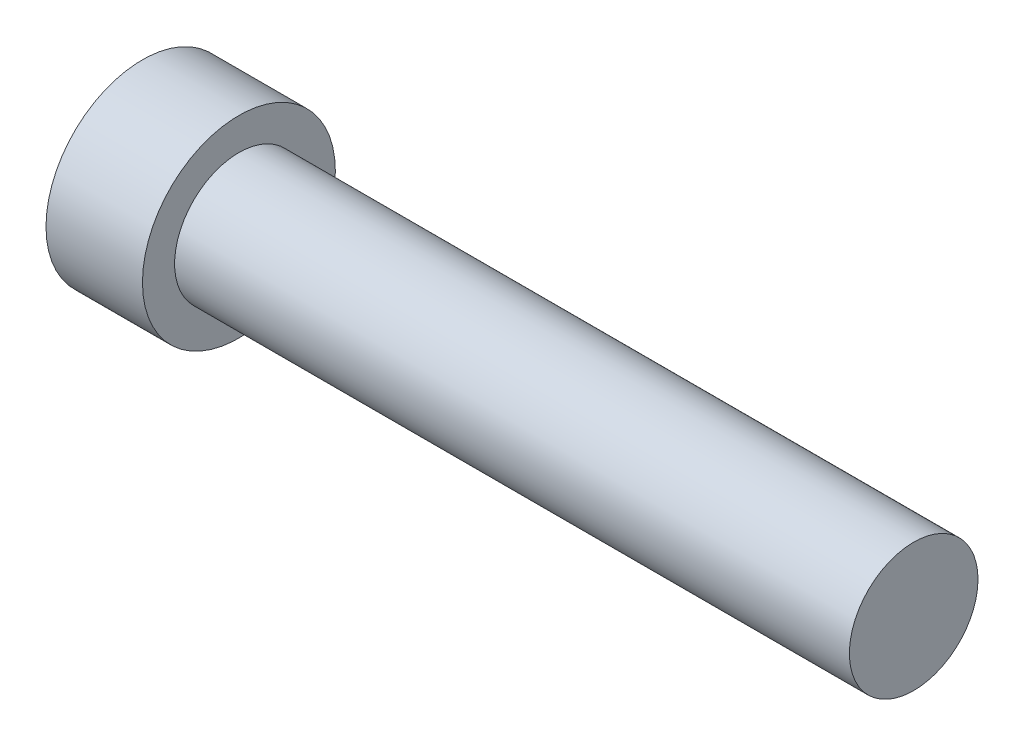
from build123d import *

# Parameters (mm, degrees)
SKETCH1_R           = 15
BOSS_EXTRUDE1_DEPTH = 15
SKETCH2_R           = 10
BOSS_EXTRUDE2_DEPTH = 104.94


with BuildPart() as part:
    # Sketch1 → Boss-Extrude1 (new body)
    with BuildSketch(Plane.YZ):
        with Locations(Location((0, 0, 0), (0, 0, 270))):
            Circle(SKETCH1_R)
    extrude(amount=BOSS_EXTRUDE1_DEPTH)

    # Sketch2 → Boss-Extrude2 (add)
    with BuildSketch(Plane.YZ.offset(15)):
        with Locations(Location((0, 0, 0), (0, 0, 270))):
            Circle(SKETCH2_R)
    extrude(amount=BOSS_EXTRUDE2_DEPTH)


solid = part.part
